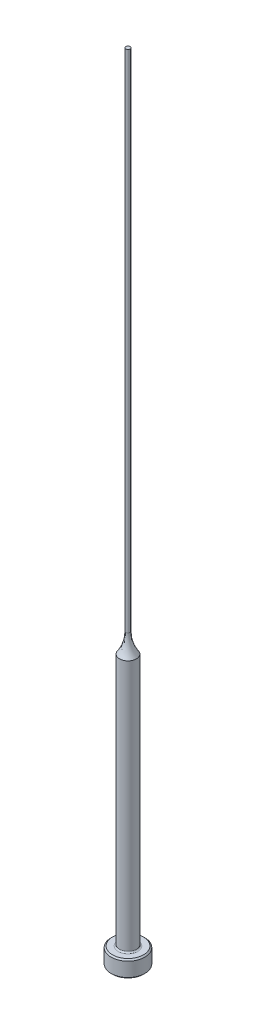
ISO-10303-21;
HEADER;
FILE_DESCRIPTION(('STEP AP214'),'2;1');
FILE_NAME('part.step','',(''),(''),'','','');
FILE_SCHEMA(('AUTOMOTIVE_DESIGN { 1 0 10303 214 1 1 1 1 }'));
ENDSEC;
DATA;
#1=APPLICATION_CONTEXT('core data for automotive mechanical design processes');
#2=APPLICATION_PROTOCOL_DEFINITION('international standard','automotive_design',2000,#1);
#3=PRODUCT_CONTEXT('',#1,'mechanical');
#4=PRODUCT('Part','Part','',(#3));
#5=PRODUCT_RELATED_PRODUCT_CATEGORY('part','',(#4));
#6=PRODUCT_DEFINITION_FORMATION('','',#4);
#7=PRODUCT_DEFINITION_CONTEXT('part definition',#1,'design');
#8=PRODUCT_DEFINITION('design','',#6,#7);
#9=PRODUCT_DEFINITION_SHAPE('','',#8);
#10=(LENGTH_UNIT() NAMED_UNIT(*) SI_UNIT(.MILLI.,.METRE.));
#11=(NAMED_UNIT(*) PLANE_ANGLE_UNIT() SI_UNIT($,.RADIAN.));
#12=(NAMED_UNIT(*) SI_UNIT($,.STERADIAN.) SOLID_ANGLE_UNIT());
#13=UNCERTAINTY_MEASURE_WITH_UNIT(LENGTH_MEASURE(1.E-05),#10,'distance_accuracy_value','');
#14=(GEOMETRIC_REPRESENTATION_CONTEXT(3) GLOBAL_UNCERTAINTY_ASSIGNED_CONTEXT((#13)) GLOBAL_UNIT_ASSIGNED_CONTEXT((#10,
#11,#12)) REPRESENTATION_CONTEXT('',''));
#15=CARTESIAN_POINT('',(0.,0.,0.));
#16=DIRECTION('',(0.,0.,1.));
#17=DIRECTION('',(1.,0.,0.));
#18=AXIS2_PLACEMENT_3D('',#15,#16,#17);
#19=CARTESIAN_POINT('',(-0.396239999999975,149.733,0.));
#20=DIRECTION('',(0.,1.,0.));
#21=DIRECTION('',(0.,0.,1.));
#22=AXIS2_PLACEMENT_3D('',#19,#20,#21);
#23=PLANE('',#22);
#24=CARTESIAN_POINT('',(0.,149.733,0.));
#25=DIRECTION('',(0.,1.,0.));
#26=DIRECTION('',(0.,0.,1.));
#27=AXIS2_PLACEMENT_3D('',#24,#25,#26);
#28=CIRCLE('',#27,0.396239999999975);
#29=CARTESIAN_POINT('',(0.,149.733,0.396239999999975));
#30=VERTEX_POINT('',#29);
#31=EDGE_CURVE('E61',#30,#30,#28,.T.);
#32=ORIENTED_EDGE('',*,*,#31,.T.);
#33=EDGE_LOOP('',(#32));
#34=FACE_BOUND('',#33,.T.);
#35=ADVANCED_FACE('F35',(#34),#23,.T.);
#36=CARTESIAN_POINT('',(0.,259.958771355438,0.));
#37=DIRECTION('',(0.,1.,0.));
#38=DIRECTION('',(0.,0.,1.));
#39=AXIS2_PLACEMENT_3D('',#36,#37,#38);
#40=CYLINDRICAL_SURFACE('',#39,0.396239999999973);
#41=CARTESIAN_POINT('',(0.,54.5026884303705,0.));
#42=DIRECTION('',(0.,1.,0.));
#43=DIRECTION('',(0.,0.,1.));
#44=AXIS2_PLACEMENT_3D('',#41,#42,#43);
#45=CIRCLE('',#44,0.396239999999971);
#46=CARTESIAN_POINT('',(0.,54.5026884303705,0.396239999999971));
#47=VERTEX_POINT('',#46);
#48=EDGE_CURVE('E64',#47,#47,#45,.T.);
#49=ORIENTED_EDGE('',*,*,#48,.T.);
#50=EDGE_LOOP('',(#49));
#51=FACE_BOUND('',#50,.T.);
#52=ORIENTED_EDGE('',*,*,#31,.F.);
#53=EDGE_LOOP('',(#52));
#54=FACE_BOUND('',#53,.T.);
#55=ADVANCED_FACE('F84',(#51,#54),#40,.T.);
#56=CARTESIAN_POINT('',(0.,54.5026884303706,0.));
#57=DIRECTION('',(0.,1.,0.));
#58=DIRECTION('',(0.,0.,1.));
#59=AXIS2_PLACEMENT_3D('',#56,#57,#58);
#60=TOROIDAL_SURFACE('',#59,6.74623999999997,6.35);
#61=CARTESIAN_POINT('',(0.,50.8,0.));
#62=DIRECTION('',(0.,1.,0.));
#63=DIRECTION('',(0.,0.,1.));
#64=AXIS2_PLACEMENT_3D('',#61,#62,#63);
#65=CIRCLE('',#64,1.58749999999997);
#66=CARTESIAN_POINT('',(0.,50.8,1.58749999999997));
#67=VERTEX_POINT('',#66);
#68=EDGE_CURVE('E67',#67,#67,#65,.T.);
#69=ORIENTED_EDGE('',*,*,#68,.T.);
#70=EDGE_LOOP('',(#69));
#71=FACE_BOUND('',#70,.T.);
#72=ORIENTED_EDGE('',*,*,#48,.F.);
#73=EDGE_LOOP('',(#72));
#74=FACE_BOUND('',#73,.T.);
#75=ADVANCED_FACE('F71',(#71,#74),#60,.F.);
#76=CARTESIAN_POINT('',(0.,259.958771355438,0.));
#77=DIRECTION('',(0.,1.,0.));
#78=DIRECTION('',(0.,0.,1.));
#79=AXIS2_PLACEMENT_3D('',#76,#77,#78);
#80=CYLINDRICAL_SURFACE('',#79,1.58749999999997);
#81=CARTESIAN_POINT('',(0.,3.42900000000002,0.));
#82=DIRECTION('',(0.,1.,0.));
#83=DIRECTION('',(0.,0.,1.));
#84=AXIS2_PLACEMENT_3D('',#81,#82,#83);
#85=CIRCLE('',#84,1.58749999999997);
#86=CARTESIAN_POINT('',(0.,3.42900000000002,1.58749999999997));
#87=VERTEX_POINT('',#86);
#88=EDGE_CURVE('E42',#87,#87,#85,.T.);
#89=ORIENTED_EDGE('',*,*,#88,.T.);
#90=EDGE_LOOP('',(#89));
#91=FACE_BOUND('',#90,.T.);
#92=ORIENTED_EDGE('',*,*,#68,.F.);
#93=EDGE_LOOP('',(#92));
#94=FACE_BOUND('',#93,.T.);
#95=ADVANCED_FACE('F74',(#91,#94),#80,.T.);
#96=CARTESIAN_POINT('',(-3.17499999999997,3.175,0.));
#97=DIRECTION('',(0.,1.,0.));
#98=DIRECTION('',(0.,0.,1.));
#99=AXIS2_PLACEMENT_3D('',#96,#97,#98);
#100=PLANE('',#99);
#101=CARTESIAN_POINT('',(0.,3.175,0.));
#102=DIRECTION('',(0.,1.,0.));
#103=DIRECTION('',(0.,0.,1.));
#104=AXIS2_PLACEMENT_3D('',#101,#102,#103);
#105=CIRCLE('',#104,1.84149999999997);
#106=CARTESIAN_POINT('',(0.,3.175,1.84149999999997));
#107=VERTEX_POINT('',#106);
#108=EDGE_CURVE('E10',#107,#107,#105,.F.);
#109=ORIENTED_EDGE('',*,*,#108,.T.);
#110=EDGE_LOOP('',(#109));
#111=FACE_BOUND('',#110,.T.);
#112=CARTESIAN_POINT('',(0.,3.175,0.));
#113=DIRECTION('',(0.,1.,0.));
#114=DIRECTION('',(0.,0.,1.));
#115=AXIS2_PLACEMENT_3D('',#112,#113,#114);
#116=CIRCLE('',#115,2.92099999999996);
#117=CARTESIAN_POINT('',(0.,3.175,2.92099999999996));
#118=VERTEX_POINT('',#117);
#119=EDGE_CURVE('E58',#118,#118,#116,.T.);
#120=ORIENTED_EDGE('',*,*,#119,.T.);
#121=EDGE_LOOP('',(#120));
#122=FACE_BOUND('',#121,.T.);
#123=ADVANCED_FACE('F76',(#111,#122),#100,.T.);
#124=CARTESIAN_POINT('',(0.,259.958771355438,0.));
#125=DIRECTION('',(0.,1.,0.));
#126=DIRECTION('',(0.,0.,1.));
#127=AXIS2_PLACEMENT_3D('',#124,#125,#126);
#128=CYLINDRICAL_SURFACE('',#127,3.17499999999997);
#129=CARTESIAN_POINT('',(0.,2.92100000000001,0.));
#130=DIRECTION('',(0.,1.,0.));
#131=DIRECTION('',(0.,0.,1.));
#132=AXIS2_PLACEMENT_3D('',#129,#130,#131);
#133=CIRCLE('',#132,3.17499999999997);
#134=CARTESIAN_POINT('',(0.,2.92100000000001,3.17499999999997));
#135=VERTEX_POINT('',#134);
#136=EDGE_CURVE('E50',#135,#135,#133,.F.);
#137=ORIENTED_EDGE('',*,*,#136,.T.);
#138=EDGE_LOOP('',(#137));
#139=FACE_BOUND('',#138,.T.);
#140=CARTESIAN_POINT('',(0.,0.254000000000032,0.));
#141=DIRECTION('',(0.,-1.,0.));
#142=DIRECTION('',(0.,0.,-1.));
#143=AXIS2_PLACEMENT_3D('',#140,#141,#142);
#144=CIRCLE('',#143,3.17499999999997);
#145=CARTESIAN_POINT('',(0.,0.254000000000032,-3.17499999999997));
#146=VERTEX_POINT('',#145);
#147=EDGE_CURVE('E55',#146,#146,#144,.F.);
#148=ORIENTED_EDGE('',*,*,#147,.T.);
#149=EDGE_LOOP('',(#148));
#150=FACE_BOUND('',#149,.T.);
#151=ADVANCED_FACE('F82',(#139,#150),#128,.T.);
#152=CARTESIAN_POINT('',(0.,0.,0.));
#153=DIRECTION('',(0.,-1.,0.));
#154=DIRECTION('',(0.,0.,-1.));
#155=AXIS2_PLACEMENT_3D('',#152,#153,#154);
#156=PLANE('',#155);
#157=CARTESIAN_POINT('',(0.,0.,0.));
#158=DIRECTION('',(0.,-1.,0.));
#159=DIRECTION('',(0.,0.,-1.));
#160=AXIS2_PLACEMENT_3D('',#157,#158,#159);
#161=CIRCLE('',#160,2.92099999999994);
#162=CARTESIAN_POINT('',(0.,0.,-2.92099999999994));
#163=VERTEX_POINT('',#162);
#164=EDGE_CURVE('E46',#163,#163,#161,.T.);
#165=ORIENTED_EDGE('',*,*,#164,.T.);
#166=EDGE_LOOP('',(#165));
#167=FACE_BOUND('',#166,.T.);
#168=ADVANCED_FACE('F98',(#167),#156,.T.);
#169=CARTESIAN_POINT('',(0.,3.17499999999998,0.));
#170=DIRECTION('',(0.,-1.,0.));
#171=DIRECTION('',(0.,0.,-1.));
#172=AXIS2_PLACEMENT_3D('',#169,#170,#171);
#173=CONICAL_SURFACE('',#172,2.92099999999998,0.785398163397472);
#174=ORIENTED_EDGE('',*,*,#136,.F.);
#175=EDGE_LOOP('',(#174));
#176=FACE_BOUND('',#175,.T.);
#177=ORIENTED_EDGE('',*,*,#119,.F.);
#178=EDGE_LOOP('',(#177));
#179=FACE_BOUND('',#178,.T.);
#180=ADVANCED_FACE('F95',(#176,#179),#173,.T.);
#181=CARTESIAN_POINT('',(0.,0.254000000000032,0.));
#182=DIRECTION('',(0.,1.,0.));
#183=DIRECTION('',(0.,0.,1.));
#184=AXIS2_PLACEMENT_3D('',#181,#182,#183);
#185=CONICAL_SURFACE('',#184,3.17499999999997,0.785398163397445);
#186=ORIENTED_EDGE('',*,*,#164,.F.);
#187=EDGE_LOOP('',(#186));
#188=FACE_BOUND('',#187,.T.);
#189=ORIENTED_EDGE('',*,*,#147,.F.);
#190=EDGE_LOOP('',(#189));
#191=FACE_BOUND('',#190,.T.);
#192=ADVANCED_FACE('F97',(#188,#191),#185,.T.);
#193=CARTESIAN_POINT('',(0.,3.42900000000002,0.));
#194=DIRECTION('',(0.,1.,0.));
#195=DIRECTION('',(0.,0.,1.));
#196=AXIS2_PLACEMENT_3D('',#193,#194,#195);
#197=TOROIDAL_SURFACE('',#196,1.84149999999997,0.254);
#198=ORIENTED_EDGE('',*,*,#108,.F.);
#199=EDGE_LOOP('',(#198));
#200=FACE_BOUND('',#199,.T.);
#201=ORIENTED_EDGE('',*,*,#88,.F.);
#202=EDGE_LOOP('',(#201));
#203=FACE_BOUND('',#202,.T.);
#204=ADVANCED_FACE('F37',(#200,#203),#197,.F.);
#205=CLOSED_SHELL('',(#35,#55,#75,#95,#123,#151,#168,#180,#192,#204));
#206=MANIFOLD_SOLID_BREP('B2',#205);
#207=ADVANCED_BREP_SHAPE_REPRESENTATION('',(#18,#206),#14);
#208=SHAPE_DEFINITION_REPRESENTATION(#9,#207);
ENDSEC;
END-ISO-10303-21;
